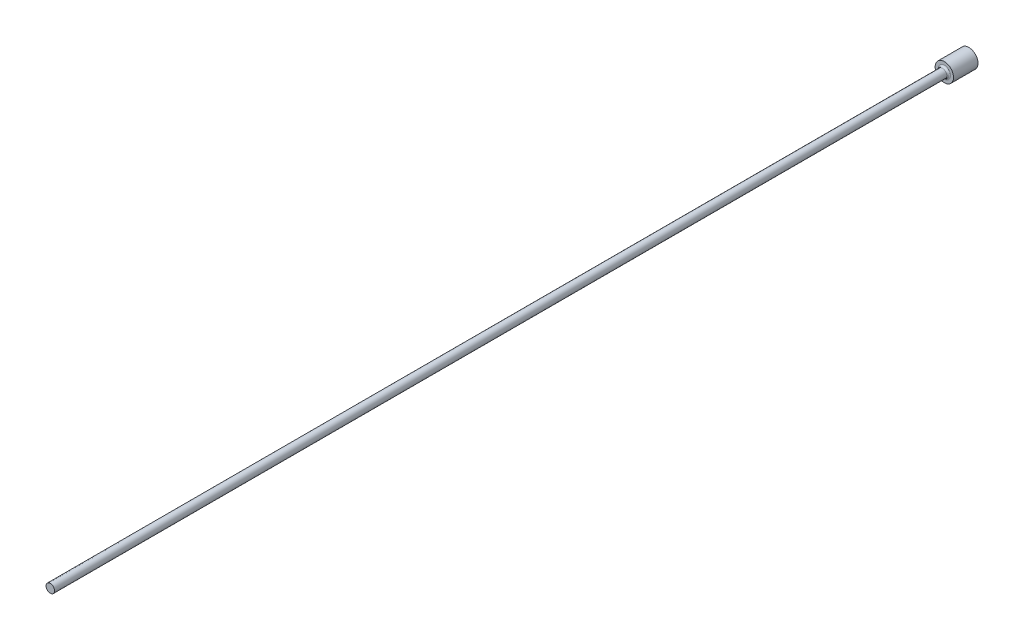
from build123d import *

# Parameters (mm, degrees)
FILLET1_R = 0.3


with BuildPart() as part:
    # FV → Revolve1 (revolve)
    with BuildSketch(Plane(origin=(0, 0, 0), x_dir=(1, 0, 0), z_dir=(0, 1, 0)), mode=Mode.PRIVATE) as revolve1_sk:
        Polygon((0, 0), (1.5, 0), (1.5, -4), (0.7, -4), (0.7, -150), (0, -150), align=None)
    revolve(revolve1_sk.sketch.rotate(Axis((0, 0, -9.033228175), (0, 0, 1)), 180), axis=Axis((0, 0, -9.033228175), (0, 0, 1)))

    # Fillet1
    fillet1_edges = [part.edges().sort_by_distance(p)[0] for p in [
        (0.7, 0, 4),
    ]]
    fillet(fillet1_edges, radius=FILLET1_R)


solid = part.part
